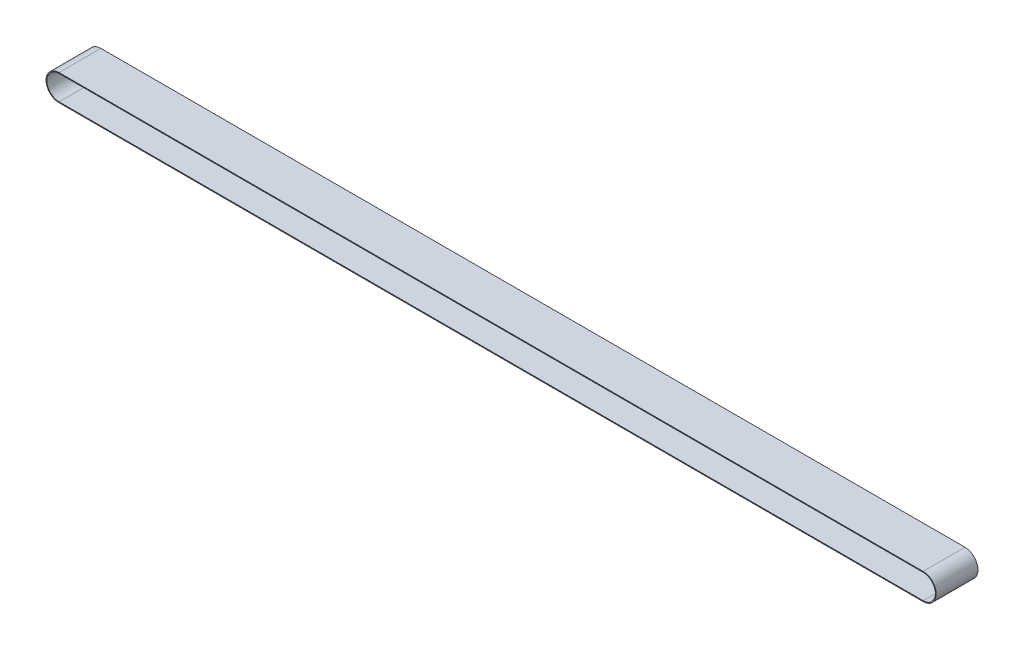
ISO-10303-21;
HEADER;
FILE_DESCRIPTION(('STEP AP214'),'2;1');
FILE_NAME('part.step','',(''),(''),'','','');
FILE_SCHEMA(('AUTOMOTIVE_DESIGN { 1 0 10303 214 1 1 1 1 }'));
ENDSEC;
DATA;
#1=APPLICATION_CONTEXT('core data for automotive mechanical design processes');
#2=APPLICATION_PROTOCOL_DEFINITION('international standard','automotive_design',2000,#1);
#3=PRODUCT_CONTEXT('',#1,'mechanical');
#4=PRODUCT('Part','Part','',(#3));
#5=PRODUCT_RELATED_PRODUCT_CATEGORY('part','',(#4));
#6=PRODUCT_DEFINITION_FORMATION('','',#4);
#7=PRODUCT_DEFINITION_CONTEXT('part definition',#1,'design');
#8=PRODUCT_DEFINITION('design','',#6,#7);
#9=PRODUCT_DEFINITION_SHAPE('','',#8);
#10=(LENGTH_UNIT() NAMED_UNIT(*) SI_UNIT(.MILLI.,.METRE.));
#11=(NAMED_UNIT(*) PLANE_ANGLE_UNIT() SI_UNIT($,.RADIAN.));
#12=(NAMED_UNIT(*) SI_UNIT($,.STERADIAN.) SOLID_ANGLE_UNIT());
#13=UNCERTAINTY_MEASURE_WITH_UNIT(LENGTH_MEASURE(1.E-05),#10,'distance_accuracy_value','');
#14=(GEOMETRIC_REPRESENTATION_CONTEXT(3) GLOBAL_UNCERTAINTY_ASSIGNED_CONTEXT((#13)) GLOBAL_UNIT_ASSIGNED_CONTEXT((#10,
#11,#12)) REPRESENTATION_CONTEXT('',''));
#15=CARTESIAN_POINT('',(0.,0.,0.));
#16=DIRECTION('',(0.,0.,1.));
#17=DIRECTION('',(1.,0.,0.));
#18=AXIS2_PLACEMENT_3D('',#15,#16,#17);
#19=CARTESIAN_POINT('',(1498.5,135.999999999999,37.5));
#20=DIRECTION('',(0.,0.,-1.));
#21=DIRECTION('',(-1.,0.,0.));
#22=AXIS2_PLACEMENT_3D('',#19,#20,#21);
#23=PLANE('',#22);
#24=CARTESIAN_POINT('',(1498.5,135.999999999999,37.5));
#25=DIRECTION('',(0.,0.,-1.));
#26=DIRECTION('',(-1.,0.,0.));
#27=AXIS2_PLACEMENT_3D('',#24,#25,#26);
#28=CIRCLE('',#27,23.5);
#29=CARTESIAN_POINT('',(1498.5,112.499999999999,37.5));
#30=VERTEX_POINT('',#29);
#31=CARTESIAN_POINT('',(1498.5,159.499999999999,37.5));
#32=VERTEX_POINT('',#31);
#33=EDGE_CURVE('E166',#30,#32,#28,.F.);
#34=ORIENTED_EDGE('',*,*,#33,.T.);
#35=DIRECTION('',(-1.,0.,0.));
#36=VECTOR('',#35,1.);
#37=CARTESIAN_POINT('',(1498.5,159.499999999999,37.5));
#38=LINE('',#37,#36);
#39=CARTESIAN_POINT('',(-51.4999999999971,159.5,37.5));
#40=VERTEX_POINT('',#39);
#41=EDGE_CURVE('E169',#32,#40,#38,.T.);
#42=ORIENTED_EDGE('',*,*,#41,.T.);
#43=CARTESIAN_POINT('',(-51.4999999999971,136.,37.5));
#44=DIRECTION('',(0.,0.,-1.));
#45=DIRECTION('',(-1.,0.,0.));
#46=AXIS2_PLACEMENT_3D('',#43,#44,#45);
#47=CIRCLE('',#46,23.5);
#48=CARTESIAN_POINT('',(-51.4999999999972,112.5,37.5));
#49=VERTEX_POINT('',#48);
#50=EDGE_CURVE('E172',#40,#49,#47,.F.);
#51=ORIENTED_EDGE('',*,*,#50,.T.);
#52=DIRECTION('',(1.,0.,0.));
#53=VECTOR('',#52,1.);
#54=CARTESIAN_POINT('',(1498.5,112.499999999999,37.5));
#55=LINE('',#54,#53);
#56=EDGE_CURVE('E174',#49,#30,#55,.T.);
#57=ORIENTED_EDGE('',*,*,#56,.T.);
#58=EDGE_LOOP('',(#34,#42,#51,#57));
#59=FACE_BOUND('',#58,.T.);
#60=CARTESIAN_POINT('',(1498.5,135.999999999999,37.5));
#61=DIRECTION('',(0.,0.,1.));
#62=DIRECTION('',(-1.,0.,0.));
#63=AXIS2_PLACEMENT_3D('',#60,#61,#62);
#64=CIRCLE('',#63,22.);
#65=CARTESIAN_POINT('',(1498.5,113.999999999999,37.5));
#66=VERTEX_POINT('',#65);
#67=CARTESIAN_POINT('',(1498.5,157.999999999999,37.5));
#68=VERTEX_POINT('',#67);
#69=EDGE_CURVE('E130',#66,#68,#64,.T.);
#70=ORIENTED_EDGE('',*,*,#69,.F.);
#71=DIRECTION('',(1.,0.,0.));
#72=VECTOR('',#71,1.);
#73=CARTESIAN_POINT('',(1498.5,113.999999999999,37.5));
#74=LINE('',#73,#72);
#75=CARTESIAN_POINT('',(-51.4999999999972,114.,37.5));
#76=VERTEX_POINT('',#75);
#77=EDGE_CURVE('E152',#76,#66,#74,.T.);
#78=ORIENTED_EDGE('',*,*,#77,.F.);
#79=CARTESIAN_POINT('',(-51.4999999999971,136.,37.5));
#80=DIRECTION('',(0.,0.,1.));
#81=DIRECTION('',(-1.,0.,0.));
#82=AXIS2_PLACEMENT_3D('',#79,#80,#81);
#83=CIRCLE('',#82,22.);
#84=CARTESIAN_POINT('',(-51.4999999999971,158.,37.5));
#85=VERTEX_POINT('',#84);
#86=EDGE_CURVE('E150',#85,#76,#83,.T.);
#87=ORIENTED_EDGE('',*,*,#86,.F.);
#88=DIRECTION('',(-1.,0.,0.));
#89=VECTOR('',#88,1.);
#90=CARTESIAN_POINT('',(-51.4999999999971,158.,37.5));
#91=LINE('',#90,#89);
#92=EDGE_CURVE('E138',#68,#85,#91,.T.);
#93=ORIENTED_EDGE('',*,*,#92,.F.);
#94=EDGE_LOOP('',(#70,#78,#87,#93));
#95=FACE_BOUND('',#94,.T.);
#96=ADVANCED_FACE('F65',(#59,#95),#23,.F.);
#97=CARTESIAN_POINT('',(1498.5,135.999999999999,-37.5));
#98=DIRECTION('',(0.,0.,-1.));
#99=DIRECTION('',(-1.,0.,0.));
#100=AXIS2_PLACEMENT_3D('',#97,#98,#99);
#101=PLANE('',#100);
#102=CARTESIAN_POINT('',(1498.5,135.999999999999,-37.5));
#103=DIRECTION('',(0.,0.,-1.));
#104=DIRECTION('',(-1.,0.,0.));
#105=AXIS2_PLACEMENT_3D('',#102,#103,#104);
#106=CIRCLE('',#105,23.5);
#107=CARTESIAN_POINT('',(1498.5,112.499999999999,-37.5));
#108=VERTEX_POINT('',#107);
#109=CARTESIAN_POINT('',(1498.5,159.499999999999,-37.5));
#110=VERTEX_POINT('',#109);
#111=EDGE_CURVE('E146',#108,#110,#106,.F.);
#112=ORIENTED_EDGE('',*,*,#111,.F.);
#113=DIRECTION('',(1.,0.,0.));
#114=VECTOR('',#113,1.);
#115=CARTESIAN_POINT('',(1498.5,112.499999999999,-37.5));
#116=LINE('',#115,#114);
#117=CARTESIAN_POINT('',(-51.4999999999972,112.5,-37.5));
#118=VERTEX_POINT('',#117);
#119=EDGE_CURVE('E170',#118,#108,#116,.T.);
#120=ORIENTED_EDGE('',*,*,#119,.F.);
#121=CARTESIAN_POINT('',(-51.4999999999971,136.,-37.5));
#122=DIRECTION('',(0.,0.,-1.));
#123=DIRECTION('',(-1.,0.,0.));
#124=AXIS2_PLACEMENT_3D('',#121,#122,#123);
#125=CIRCLE('',#124,23.5);
#126=CARTESIAN_POINT('',(-51.4999999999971,159.5,-37.5));
#127=VERTEX_POINT('',#126);
#128=EDGE_CURVE('E181',#127,#118,#125,.F.);
#129=ORIENTED_EDGE('',*,*,#128,.F.);
#130=DIRECTION('',(-1.,0.,0.));
#131=VECTOR('',#130,1.);
#132=CARTESIAN_POINT('',(1498.5,159.499999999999,-37.5));
#133=LINE('',#132,#131);
#134=EDGE_CURVE('E179',#110,#127,#133,.T.);
#135=ORIENTED_EDGE('',*,*,#134,.F.);
#136=EDGE_LOOP('',(#112,#120,#129,#135));
#137=FACE_BOUND('',#136,.T.);
#138=DIRECTION('',(1.,0.,0.));
#139=VECTOR('',#138,1.);
#140=CARTESIAN_POINT('',(1498.5,113.999999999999,-37.5));
#141=LINE('',#140,#139);
#142=CARTESIAN_POINT('',(-51.4999999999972,114.,-37.5));
#143=VERTEX_POINT('',#142);
#144=CARTESIAN_POINT('',(1498.5,113.999999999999,-37.5));
#145=VERTEX_POINT('',#144);
#146=EDGE_CURVE('E139',#143,#145,#141,.T.);
#147=ORIENTED_EDGE('',*,*,#146,.T.);
#148=CARTESIAN_POINT('',(1498.5,135.999999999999,-37.5));
#149=DIRECTION('',(0.,0.,1.));
#150=DIRECTION('',(-1.,0.,0.));
#151=AXIS2_PLACEMENT_3D('',#148,#149,#150);
#152=CIRCLE('',#151,22.);
#153=CARTESIAN_POINT('',(1498.5,157.999999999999,-37.5));
#154=VERTEX_POINT('',#153);
#155=EDGE_CURVE('E88',#145,#154,#152,.T.);
#156=ORIENTED_EDGE('',*,*,#155,.T.);
#157=DIRECTION('',(-1.,0.,0.));
#158=VECTOR('',#157,1.);
#159=CARTESIAN_POINT('',(-51.4999999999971,158.,-37.5));
#160=LINE('',#159,#158);
#161=CARTESIAN_POINT('',(-51.4999999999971,158.,-37.5));
#162=VERTEX_POINT('',#161);
#163=EDGE_CURVE('E145',#154,#162,#160,.T.);
#164=ORIENTED_EDGE('',*,*,#163,.T.);
#165=CARTESIAN_POINT('',(-51.4999999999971,136.,-37.5));
#166=DIRECTION('',(0.,0.,1.));
#167=DIRECTION('',(-1.,0.,0.));
#168=AXIS2_PLACEMENT_3D('',#165,#166,#167);
#169=CIRCLE('',#168,22.);
#170=EDGE_CURVE('E158',#162,#143,#169,.T.);
#171=ORIENTED_EDGE('',*,*,#170,.T.);
#172=EDGE_LOOP('',(#147,#156,#164,#171));
#173=FACE_BOUND('',#172,.T.);
#174=ADVANCED_FACE('F199',(#137,#173),#101,.T.);
#175=CARTESIAN_POINT('',(1498.5,135.999999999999,37.5));
#176=DIRECTION('',(0.,0.,-1.));
#177=DIRECTION('',(-1.,0.,0.));
#178=AXIS2_PLACEMENT_3D('',#175,#176,#177);
#179=CYLINDRICAL_SURFACE('',#178,23.5);
#180=ORIENTED_EDGE('',*,*,#111,.T.);
#181=DIRECTION('',(0.,0.,-1.));
#182=VECTOR('',#181,1.);
#183=CARTESIAN_POINT('',(1498.5,159.499999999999,37.5));
#184=LINE('',#183,#182);
#185=EDGE_CURVE('E12',#32,#110,#184,.T.);
#186=ORIENTED_EDGE('',*,*,#185,.F.);
#187=ORIENTED_EDGE('',*,*,#33,.F.);
#188=DIRECTION('',(0.,0.,-1.));
#189=VECTOR('',#188,1.);
#190=CARTESIAN_POINT('',(1498.5,112.499999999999,37.5));
#191=LINE('',#190,#189);
#192=EDGE_CURVE('E176',#30,#108,#191,.T.);
#193=ORIENTED_EDGE('',*,*,#192,.T.);
#194=EDGE_LOOP('',(#180,#186,#187,#193));
#195=FACE_BOUND('',#194,.T.);
#196=ADVANCED_FACE('F67',(#195),#179,.T.);
#197=CARTESIAN_POINT('',(1498.5,159.499999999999,37.5));
#198=DIRECTION('',(0.,-1.,0.));
#199=DIRECTION('',(1.,0.,0.));
#200=AXIS2_PLACEMENT_3D('',#197,#198,#199);
#201=PLANE('',#200);
#202=ORIENTED_EDGE('',*,*,#134,.T.);
#203=DIRECTION('',(0.,0.,-1.));
#204=VECTOR('',#203,1.);
#205=CARTESIAN_POINT('',(-51.4999999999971,159.5,37.5));
#206=LINE('',#205,#204);
#207=EDGE_CURVE('E73',#40,#127,#206,.T.);
#208=ORIENTED_EDGE('',*,*,#207,.F.);
#209=ORIENTED_EDGE('',*,*,#41,.F.);
#210=ORIENTED_EDGE('',*,*,#185,.T.);
#211=EDGE_LOOP('',(#202,#208,#209,#210));
#212=FACE_BOUND('',#211,.T.);
#213=ADVANCED_FACE('F209',(#212),#201,.F.);
#214=CARTESIAN_POINT('',(-51.4999999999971,136.,37.5));
#215=DIRECTION('',(0.,0.,-1.));
#216=DIRECTION('',(-1.,0.,0.));
#217=AXIS2_PLACEMENT_3D('',#214,#215,#216);
#218=CYLINDRICAL_SURFACE('',#217,23.5);
#219=ORIENTED_EDGE('',*,*,#128,.T.);
#220=DIRECTION('',(0.,0.,-1.));
#221=VECTOR('',#220,1.);
#222=CARTESIAN_POINT('',(-51.4999999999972,112.5,37.5));
#223=LINE('',#222,#221);
#224=EDGE_CURVE('E186',#49,#118,#223,.T.);
#225=ORIENTED_EDGE('',*,*,#224,.F.);
#226=ORIENTED_EDGE('',*,*,#50,.F.);
#227=ORIENTED_EDGE('',*,*,#207,.T.);
#228=EDGE_LOOP('',(#219,#225,#226,#227));
#229=FACE_BOUND('',#228,.T.);
#230=ADVANCED_FACE('F193',(#229),#218,.T.);
#231=CARTESIAN_POINT('',(1498.5,112.499999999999,37.5));
#232=DIRECTION('',(0.,1.,0.));
#233=DIRECTION('',(-1.,0.,0.));
#234=AXIS2_PLACEMENT_3D('',#231,#232,#233);
#235=PLANE('',#234);
#236=ORIENTED_EDGE('',*,*,#119,.T.);
#237=ORIENTED_EDGE('',*,*,#192,.F.);
#238=ORIENTED_EDGE('',*,*,#56,.F.);
#239=ORIENTED_EDGE('',*,*,#224,.T.);
#240=EDGE_LOOP('',(#236,#237,#238,#239));
#241=FACE_BOUND('',#240,.T.);
#242=ADVANCED_FACE('F203',(#241),#235,.F.);
#243=CARTESIAN_POINT('',(1498.5,135.999999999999,37.5));
#244=DIRECTION('',(0.,0.,-1.));
#245=DIRECTION('',(-1.,0.,0.));
#246=AXIS2_PLACEMENT_3D('',#243,#244,#245);
#247=CYLINDRICAL_SURFACE('',#246,22.);
#248=ORIENTED_EDGE('',*,*,#155,.F.);
#249=DIRECTION('',(0.,0.,-1.));
#250=VECTOR('',#249,1.);
#251=CARTESIAN_POINT('',(1498.5,113.999999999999,37.5));
#252=LINE('',#251,#250);
#253=EDGE_CURVE('E134',#66,#145,#252,.T.);
#254=ORIENTED_EDGE('',*,*,#253,.F.);
#255=ORIENTED_EDGE('',*,*,#69,.T.);
#256=DIRECTION('',(0.,0.,-1.));
#257=VECTOR('',#256,1.);
#258=CARTESIAN_POINT('',(1498.5,157.999999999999,37.5));
#259=LINE('',#258,#257);
#260=EDGE_CURVE('E133',#68,#154,#259,.T.);
#261=ORIENTED_EDGE('',*,*,#260,.T.);
#262=EDGE_LOOP('',(#248,#254,#255,#261));
#263=FACE_BOUND('',#262,.T.);
#264=ADVANCED_FACE('F132',(#263),#247,.F.);
#265=CARTESIAN_POINT('',(-51.4999999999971,158.,37.5));
#266=DIRECTION('',(0.,-1.,0.));
#267=DIRECTION('',(1.,0.,0.));
#268=AXIS2_PLACEMENT_3D('',#265,#266,#267);
#269=PLANE('',#268);
#270=ORIENTED_EDGE('',*,*,#163,.F.);
#271=ORIENTED_EDGE('',*,*,#260,.F.);
#272=ORIENTED_EDGE('',*,*,#92,.T.);
#273=DIRECTION('',(0.,0.,-1.));
#274=VECTOR('',#273,1.);
#275=CARTESIAN_POINT('',(-51.4999999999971,158.,37.5));
#276=LINE('',#275,#274);
#277=EDGE_CURVE('E147',#85,#162,#276,.T.);
#278=ORIENTED_EDGE('',*,*,#277,.T.);
#279=EDGE_LOOP('',(#270,#271,#272,#278));
#280=FACE_BOUND('',#279,.T.);
#281=ADVANCED_FACE('F142',(#280),#269,.T.);
#282=CARTESIAN_POINT('',(-51.4999999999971,136.,37.5));
#283=DIRECTION('',(0.,0.,-1.));
#284=DIRECTION('',(-1.,0.,0.));
#285=AXIS2_PLACEMENT_3D('',#282,#283,#284);
#286=CYLINDRICAL_SURFACE('',#285,22.);
#287=ORIENTED_EDGE('',*,*,#170,.F.);
#288=ORIENTED_EDGE('',*,*,#277,.F.);
#289=ORIENTED_EDGE('',*,*,#86,.T.);
#290=DIRECTION('',(0.,0.,-1.));
#291=VECTOR('',#290,1.);
#292=CARTESIAN_POINT('',(-51.4999999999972,114.,37.5));
#293=LINE('',#292,#291);
#294=EDGE_CURVE('E80',#76,#143,#293,.T.);
#295=ORIENTED_EDGE('',*,*,#294,.T.);
#296=EDGE_LOOP('',(#287,#288,#289,#295));
#297=FACE_BOUND('',#296,.T.);
#298=ADVANCED_FACE('F232',(#297),#286,.F.);
#299=CARTESIAN_POINT('',(1498.5,113.999999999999,37.5));
#300=DIRECTION('',(0.,1.,0.));
#301=DIRECTION('',(-1.,0.,0.));
#302=AXIS2_PLACEMENT_3D('',#299,#300,#301);
#303=PLANE('',#302);
#304=ORIENTED_EDGE('',*,*,#146,.F.);
#305=ORIENTED_EDGE('',*,*,#294,.F.);
#306=ORIENTED_EDGE('',*,*,#77,.T.);
#307=ORIENTED_EDGE('',*,*,#253,.T.);
#308=EDGE_LOOP('',(#304,#305,#306,#307));
#309=FACE_BOUND('',#308,.T.);
#310=ADVANCED_FACE('F236',(#309),#303,.T.);
#311=CLOSED_SHELL('',(#96,#174,#196,#213,#230,#242,#264,#281,#298,#310));
#312=MANIFOLD_SOLID_BREP('B2',#311);
#313=ADVANCED_BREP_SHAPE_REPRESENTATION('',(#18,#312),#14);
#314=SHAPE_DEFINITION_REPRESENTATION(#9,#313);
ENDSEC;
END-ISO-10303-21;
